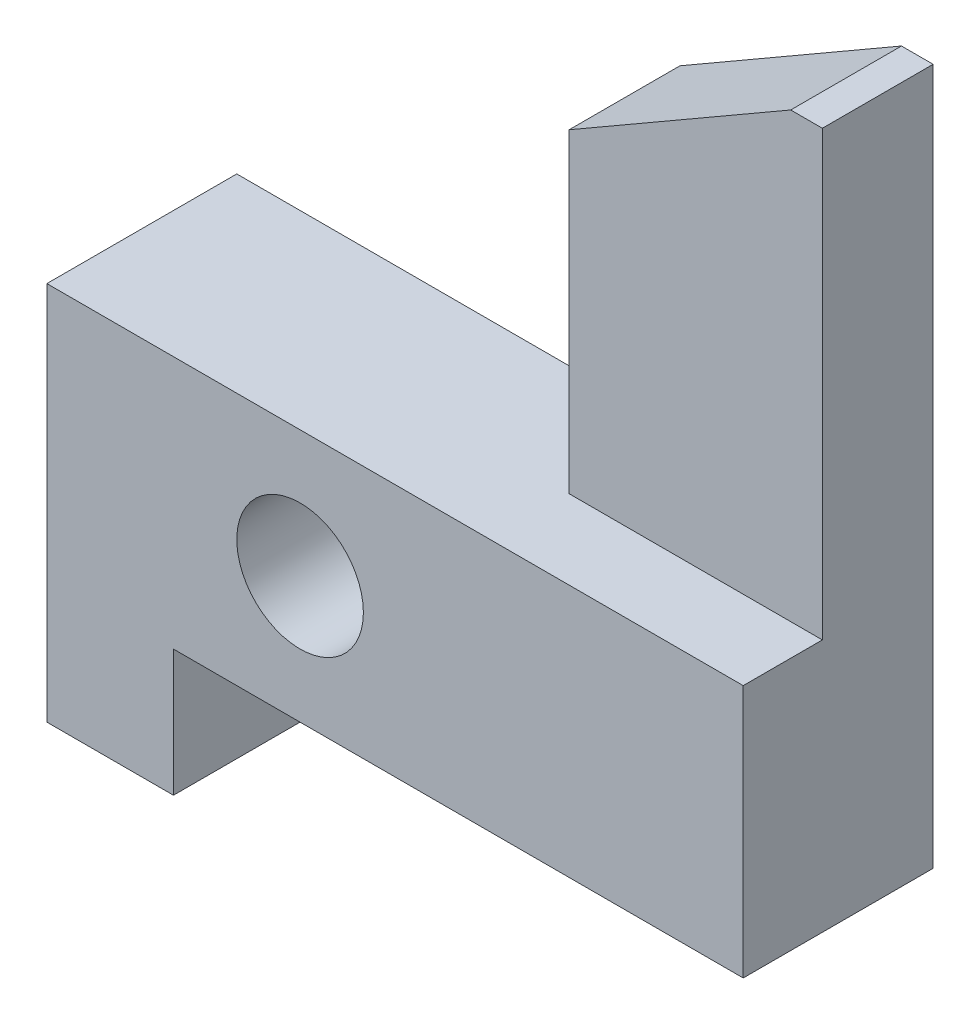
from build123d import *

# Parameters (mm, degrees)
SKETCH_1_R          = 2
EXTRUDE_1_DEPTH     = 6
SKETCH_2_OUTSIDE_W  = 14.916
SKETCH_2_OUTSIDE_H  = 34.916
CUT_EXTRUDE_1_DEPTH = 35.583232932
SKETCH_4_R          = 1.75
CUT_EXTRUDE_2_DEPTH = 3


with BuildPart() as part:
    # Sketch 1 → Extrude 1 (new body)
    with BuildSketch(Plane.XY):
        Polygon((22, 4), (22, 26), (21, 26), (14, 21.958548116), (14, 12), (0, 12), (0, 0), (4, 0), (4, 4), align=None)
        with Locations((8, 8)):
            Circle(SKETCH_1_R, mode=Mode.SUBTRACT)
    extrude(amount=EXTRUDE_1_DEPTH)

    # Sketch 2 outside → Cut-Extrude 1 (cut, through all)
    with BuildSketch(Plane(origin=(22, 0, 0), x_dir=(0, 0, -1), z_dir=(1, 0, 0))):
        with Locations((-3, 13)):
            Rectangle(SKETCH_2_OUTSIDE_W, SKETCH_2_OUTSIDE_H)
        Polygon((-3.5, 26), (0, 26), (0, 0), (-6, 0), (-6, 12), (-3.5, 12), align=None, mode=Mode.SUBTRACT)
    extrude(amount=-CUT_EXTRUDE_1_DEPTH, mode=Mode.SUBTRACT)

    # Sketch 4 → Cut-Extrude 2 (cut)
    with BuildSketch(Plane.XZ.offset(-4)):
        with Locations(Location((14, 3, 0), (0, 0, 270))):
            Circle(SKETCH_4_R)
    extrude(amount=-CUT_EXTRUDE_2_DEPTH, mode=Mode.SUBTRACT)


solid = part.part
